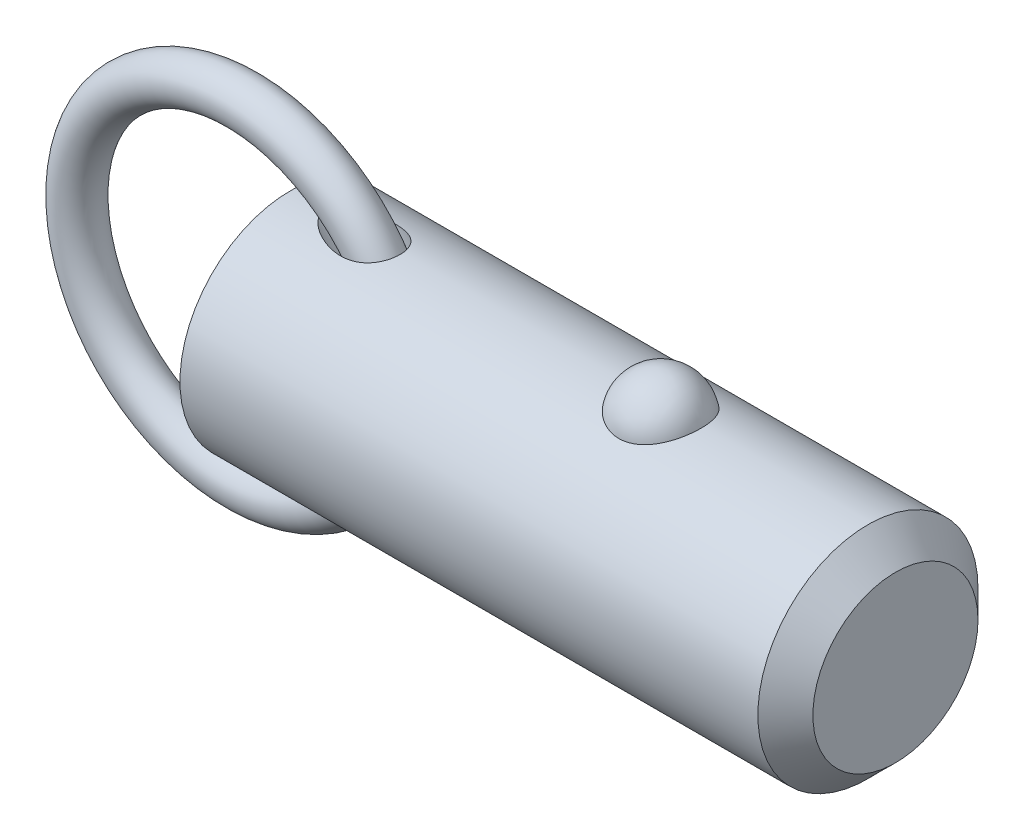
ISO-10303-21;
HEADER;
FILE_DESCRIPTION(('STEP AP214'),'2;1');
FILE_NAME('part.step','',(''),(''),'','','');
FILE_SCHEMA(('AUTOMOTIVE_DESIGN { 1 0 10303 214 1 1 1 1 }'));
ENDSEC;
DATA;
#1=APPLICATION_CONTEXT('core data for automotive mechanical design processes');
#2=APPLICATION_PROTOCOL_DEFINITION('international standard','automotive_design',2000,#1);
#3=PRODUCT_CONTEXT('',#1,'mechanical');
#4=PRODUCT('Part','Part','',(#3));
#5=PRODUCT_RELATED_PRODUCT_CATEGORY('part','',(#4));
#6=PRODUCT_DEFINITION_FORMATION('','',#4);
#7=PRODUCT_DEFINITION_CONTEXT('part definition',#1,'design');
#8=PRODUCT_DEFINITION('design','',#6,#7);
#9=PRODUCT_DEFINITION_SHAPE('','',#8);
#10=(LENGTH_UNIT() NAMED_UNIT(*) SI_UNIT(.MILLI.,.METRE.));
#11=(NAMED_UNIT(*) PLANE_ANGLE_UNIT() SI_UNIT($,.RADIAN.));
#12=(NAMED_UNIT(*) SI_UNIT($,.STERADIAN.) SOLID_ANGLE_UNIT());
#13=UNCERTAINTY_MEASURE_WITH_UNIT(LENGTH_MEASURE(1.E-05),#10,'distance_accuracy_value','');
#14=(GEOMETRIC_REPRESENTATION_CONTEXT(3) GLOBAL_UNCERTAINTY_ASSIGNED_CONTEXT((#13)) GLOBAL_UNIT_ASSIGNED_CONTEXT((#10,
#11,#12)) REPRESENTATION_CONTEXT('',''));
#15=CARTESIAN_POINT('',(0.,0.,0.));
#16=DIRECTION('',(0.,0.,1.));
#17=DIRECTION('',(1.,0.,0.));
#18=AXIS2_PLACEMENT_3D('',#15,#16,#17);
#19=CARTESIAN_POINT('',(-5.53898640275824,0.,0.));
#20=DIRECTION('',(0.,0.,1.));
#21=DIRECTION('',(1.,0.,0.));
#22=AXIS2_PLACEMENT_3D('',#19,#20,#21);
#23=TOROIDAL_SURFACE('',#22,19.05,2.54);
#24=CARTESIAN_POINT('',(16.0510135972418,0.,0.));
#25=VERTEX_POINT('',#24);
#26=VERTEX_LOOP('',#25);
#27=FACE_BOUND('',#26,.T.);
#28=ADVANCED_FACE('P0_F12',(#27),#23,.T.);
#29=CLOSED_SHELL('',(#28));
#30=MANIFOLD_SOLID_BREP('P0_B1',#29);
#31=CARTESIAN_POINT('',(0.,0.,0.));
#32=DIRECTION('',(1.,0.,0.));
#33=DIRECTION('',(0.,0.,-1.));
#34=AXIS2_PLACEMENT_3D('',#31,#32,#33);
#35=CYLINDRICAL_SURFACE('',#34,12.7);
#36=CARTESIAN_POINT('',(66.675,0.,0.));
#37=DIRECTION('',(1.,0.,0.));
#38=DIRECTION('',(0.,0.,-1.));
#39=AXIS2_PLACEMENT_3D('',#36,#37,#38);
#40=CIRCLE('',#39,12.7);
#41=CARTESIAN_POINT('',(66.675,0.,-12.7));
#42=VERTEX_POINT('',#41);
#43=EDGE_CURVE('P1_E89',#42,#42,#40,.T.);
#44=ORIENTED_EDGE('',*,*,#43,.F.);
#45=EDGE_LOOP('',(#44));
#46=FACE_BOUND('',#45,.T.);
#47=CARTESIAN_POINT('',(0.,0.,0.));
#48=DIRECTION('',(1.,0.,0.));
#49=DIRECTION('',(0.,0.,-1.));
#50=AXIS2_PLACEMENT_3D('',#47,#48,#49);
#51=CIRCLE('',#50,12.7);
#52=CARTESIAN_POINT('',(0.,0.,-12.7));
#53=VERTEX_POINT('',#52);
#54=EDGE_CURVE('P1_E52',#53,#53,#51,.T.);
#55=ORIENTED_EDGE('',*,*,#54,.T.);
#56=EDGE_LOOP('',(#55));
#57=FACE_BOUND('',#56,.T.);
#58=CARTESIAN_POINT('',(42.7600429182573,11.7500437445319,4.81938502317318));
#59=CARTESIAN_POINT('',(42.6350881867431,11.7500430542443,4.81938571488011));
#60=CARTESIAN_POINT('',(42.510144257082,11.7520975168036,4.81438658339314));
#61=CARTESIAN_POINT('',(42.2611425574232,11.760253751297,4.79442904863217));
#62=CARTESIAN_POINT('',(42.1370850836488,11.7663568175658,4.77946746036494));
#63=CARTESIAN_POINT('',(41.8909016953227,11.7824262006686,4.73971414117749));
#64=CARTESIAN_POINT('',(41.7687744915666,11.7923898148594,4.71492928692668));
#65=CARTESIAN_POINT('',(41.5271874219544,11.8158938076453,4.65571340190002));
#66=CARTESIAN_POINT('',(41.4077285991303,11.8294355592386,4.6212786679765));
#67=CARTESIAN_POINT('',(41.1725578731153,11.8596812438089,4.54309502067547));
#68=CARTESIAN_POINT('',(41.0568393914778,11.8763792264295,4.49936361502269));
#69=CARTESIAN_POINT('',(40.8296530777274,11.9124878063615,4.40287235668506));
#70=CARTESIAN_POINT('',(40.7181868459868,11.9318994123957,4.35010914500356));
#71=CARTESIAN_POINT('',(40.3912782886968,11.9934256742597,4.17881316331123));
#72=CARTESIAN_POINT('',(40.1831270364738,12.038858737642,4.04720756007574));
#73=CARTESIAN_POINT('',(39.7858509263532,12.1352173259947,3.748564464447));
#74=CARTESIAN_POINT('',(39.5974438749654,12.1862630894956,3.58061821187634));
#75=CARTESIAN_POINT('',(39.2505213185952,12.2875163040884,3.21600758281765));
#76=CARTESIAN_POINT('',(39.0920113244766,12.3377235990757,3.0193379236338));
#77=CARTESIAN_POINT('',(38.8016887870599,12.434492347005,2.592916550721));
#78=CARTESIAN_POINT('',(38.6713762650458,12.4807925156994,2.36208286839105));
#79=CARTESIAN_POINT('',(38.4494079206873,12.5623454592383,1.8807039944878));
#80=CARTESIAN_POINT('',(38.3577554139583,12.5975972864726,1.63015711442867));
#81=CARTESIAN_POINT('',(38.2140466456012,12.6538414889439,1.11298869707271));
#82=CARTESIAN_POINT('',(38.1624990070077,12.6746503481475,0.84620552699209));
#83=CARTESIAN_POINT('',(38.1019771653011,12.699153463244,0.307085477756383));
#84=CARTESIAN_POINT('',(38.0930018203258,12.7028481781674,0.0347487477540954));
#85=CARTESIAN_POINT('',(38.1177310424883,12.6927785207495,-0.506073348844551));
#86=CARTESIAN_POINT('',(38.1511899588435,12.6791146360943,-0.774571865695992));
#87=CARTESIAN_POINT('',(38.2596877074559,12.635882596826,-1.30170246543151));
#88=CARTESIAN_POINT('',(38.3347272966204,12.6063141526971,-1.5603343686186));
#89=CARTESIAN_POINT('',(38.5250000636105,12.5342328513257,-2.06083899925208));
#90=CARTESIAN_POINT('',(38.6402872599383,12.4917026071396,-2.3026886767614));
#91=CARTESIAN_POINT('',(38.9087044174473,12.3981123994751,-2.76259600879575));
#92=CARTESIAN_POINT('',(39.0618374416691,12.3470517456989,-2.98065173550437));
#93=CARTESIAN_POINT('',(39.4035077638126,12.2416045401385,-3.38786328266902));
#94=CARTESIAN_POINT('',(39.5922017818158,12.1872040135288,-3.57688418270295));
#95=CARTESIAN_POINT('',(40.0002392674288,12.0814086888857,-3.91941073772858));
#96=CARTESIAN_POINT('',(40.2195800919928,12.0300136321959,-4.07291945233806));
#97=CARTESIAN_POINT('',(40.6783753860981,11.9373542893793,-4.33691289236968));
#98=CARTESIAN_POINT('',(40.9173044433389,11.8958982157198,-4.44824125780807));
#99=CARTESIAN_POINT('',(41.4124376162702,11.8268116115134,-4.62881985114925));
#100=CARTESIAN_POINT('',(41.6686351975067,11.7991758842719,-4.69808589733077));
#101=CARTESIAN_POINT('',(42.1771640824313,11.7622209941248,-4.78983181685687));
#102=CARTESIAN_POINT('',(42.4290414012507,11.7520502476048,-4.81449025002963));
#103=CARTESIAN_POINT('',(42.9335734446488,11.7485796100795,-4.82295735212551));
#104=CARTESIAN_POINT('',(43.1862280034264,11.7552763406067,-4.80677420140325));
#105=CARTESIAN_POINT('',(43.6768341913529,11.7842584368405,-4.73525430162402));
#106=CARTESIAN_POINT('',(43.9149984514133,11.8060486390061,-4.68116061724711));
#107=CARTESIAN_POINT('',(44.3784894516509,11.8622750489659,-4.53678133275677));
#108=CARTESIAN_POINT('',(44.6038151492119,11.8967122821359,-4.44649279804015));
#109=CARTESIAN_POINT('',(45.0408018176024,11.9754603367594,-4.2298761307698));
#110=CARTESIAN_POINT('',(45.2520579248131,12.0199699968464,-4.10280539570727));
#111=CARTESIAN_POINT('',(45.6506012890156,12.1138028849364,-3.81685409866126));
#112=CARTESIAN_POINT('',(45.8378830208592,12.163127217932,-3.65796622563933));
#113=CARTESIAN_POINT('',(46.1933509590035,12.2642343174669,-3.30364864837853));
#114=CARTESIAN_POINT('',(46.3601119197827,12.3160165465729,-3.10678783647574));
#115=CARTESIAN_POINT('',(46.6595799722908,12.4142566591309,-2.68748409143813));
#116=CARTESIAN_POINT('',(46.7922809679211,12.4607135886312,-2.46503658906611));
#117=CARTESIAN_POINT('',(47.0246912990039,12.5450236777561,-1.9928951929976));
#118=CARTESIAN_POINT('',(47.123215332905,12.5825557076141,-1.7425591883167));
#119=CARTESIAN_POINT('',(47.2792277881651,12.6431720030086,-1.22773734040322));
#120=CARTESIAN_POINT('',(47.3367157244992,12.6662560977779,-0.963251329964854));
#121=CARTESIAN_POINT('',(47.4095441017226,12.6956486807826,-0.427355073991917));
#122=CARTESIAN_POINT('',(47.4248378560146,12.7019385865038,-0.1559374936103));
#123=CARTESIAN_POINT('',(47.4127794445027,12.6970201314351,0.385928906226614));
#124=CARTESIAN_POINT('',(47.3854280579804,12.6858120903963,0.656377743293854));
#125=CARTESIAN_POINT('',(47.3130609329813,12.6568455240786,1.05454017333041));
#126=CARTESIAN_POINT('',(47.2837963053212,12.6451962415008,1.18577850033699));
#127=CARTESIAN_POINT('',(47.2150228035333,12.6181819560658,1.44513808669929));
#128=CARTESIAN_POINT('',(47.1755176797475,12.6028183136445,1.57326046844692));
#129=CARTESIAN_POINT('',(47.0864397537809,12.5687547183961,1.82554978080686));
#130=CARTESIAN_POINT('',(47.0368627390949,12.5500533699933,1.9497150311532));
#131=CARTESIAN_POINT('',(46.9279211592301,12.5098093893,2.1931437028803));
#132=CARTESIAN_POINT('',(46.8685601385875,12.4882677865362,2.31240887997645));
#133=CARTESIAN_POINT('',(46.7399712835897,12.4427679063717,2.54593031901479));
#134=CARTESIAN_POINT('',(46.6706888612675,12.4187964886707,2.66015396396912));
#135=CARTESIAN_POINT('',(46.522903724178,12.3691892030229,2.88202659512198));
#136=CARTESIAN_POINT('',(46.4444044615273,12.3435539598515,2.98967802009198));
#137=CARTESIAN_POINT('',(46.2785502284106,12.2912955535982,3.19774385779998));
#138=CARTESIAN_POINT('',(46.1911918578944,12.2646720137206,3.29815546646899));
#139=CARTESIAN_POINT('',(46.0081617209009,12.2111945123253,3.49095035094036));
#140=CARTESIAN_POINT('',(45.9124932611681,12.1843406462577,3.58333679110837));
#141=CARTESIAN_POINT('',(45.7136272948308,12.1312249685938,3.75922876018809));
#142=CARTESIAN_POINT('',(45.6104503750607,12.104961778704,3.84275713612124));
#143=CARTESIAN_POINT('',(45.3970133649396,12.0537284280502,4.00056406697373));
#144=CARTESIAN_POINT('',(45.2867562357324,12.028757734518,4.07484645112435));
#145=CARTESIAN_POINT('',(45.0597550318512,11.9808306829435,4.21367959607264));
#146=CARTESIAN_POINT('',(44.9430068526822,11.9578756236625,4.27822410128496));
#147=CARTESIAN_POINT('',(44.7039425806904,11.9147184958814,4.39698483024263));
#148=CARTESIAN_POINT('',(44.5816287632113,11.894515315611,4.45120522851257));
#149=CARTESIAN_POINT('',(44.322952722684,11.8561129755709,4.55255353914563));
#150=CARTESIAN_POINT('',(44.1862237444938,11.8381764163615,4.59884858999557));
#151=CARTESIAN_POINT('',(43.9086087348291,11.8069093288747,4.67853897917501));
#152=CARTESIAN_POINT('',(43.7677245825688,11.7935767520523,4.71194005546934));
#153=CARTESIAN_POINT('',(43.4830944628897,11.7720277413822,4.76552188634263));
#154=CARTESIAN_POINT('',(43.3393488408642,11.7638106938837,4.78570422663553));
#155=CARTESIAN_POINT('',(43.0504114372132,11.7528195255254,4.81263433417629));
#156=CARTESIAN_POINT('',(42.9052198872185,11.7500445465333,4.81938421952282));
#157=CARTESIAN_POINT('',(42.7600429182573,11.7500437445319,4.81938502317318));
#158=B_SPLINE_CURVE_WITH_KNOTS('',3,(#58,#59,#60,#61,#62,#63,#64,#65,#66,#67,#68,#69,#70,#71,
#72,#73,#74,#75,#76,#77,#78,#79,#80,#81,#82,#83,#84,#85,#86,#87,#88,#89,#90,#91,#92,#93,#94,#95,
#96,#97,#98,#99,#100,#101,#102,#103,#104,#105,#106,#107,#108,#109,#110,#111,#112,#113,#114,#115,
#116,#117,#118,#119,#120,#121,#122,#123,#124,#125,#126,#127,#128,#129,#130,#131,#132,#133,#134,
#135,#136,#137,#138,#139,#140,#141,#142,#143,#144,#145,#146,#147,#148,#149,#150,#151,#152,#153,
#154,#155,#156,#157),.UNSPECIFIED.,.T.,.F.,(4,2,2,2,2,2,2,2,2,2,2,2,2,2,2,2,2,2,2,2,2,2,2,2,2,2,
2,2,2,2,2,2,2,2,2,2,2,2,2,2,2,2,2,2,2,2,2,2,2,4),(0.,0.374729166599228,0.749578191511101,
1.12416526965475,1.49889629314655,1.87292776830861,2.24709865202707,2.99481328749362,
3.76399449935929,4.53331735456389,5.3368391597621,6.14042986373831,6.95405296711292,
7.76765424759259,8.57656703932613,9.38549455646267,10.1955119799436,11.0055949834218,
11.8193353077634,12.6330054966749,13.4294141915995,14.2255231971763,14.9815786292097,
15.7374826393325,16.4696948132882,17.2019663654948,17.9501979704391,18.6986017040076,
19.4844704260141,20.2704797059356,21.0815215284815,21.8925729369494,22.7045213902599,
23.5164550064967,23.9209608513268,24.3253187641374,24.7298461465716,25.1342272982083,
25.54092555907,25.9474719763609,26.3541750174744,26.7607169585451,27.1661834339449,
27.5714814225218,27.9770386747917,28.3824315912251,28.8181206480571,29.2536155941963,
29.6890582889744,30.1244323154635),.UNSPECIFIED.);
#159=CARTESIAN_POINT('',(42.7600429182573,11.7500437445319,4.81938502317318));
#160=VERTEX_POINT('',#159);
#161=EDGE_CURVE('P1_E80',#160,#160,#158,.T.);
#162=ORIENTED_EDGE('',*,*,#161,.T.);
#163=EDGE_LOOP('',(#162));
#164=FACE_BOUND('',#163,.T.);
#165=CARTESIAN_POINT('',(-5.53898640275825,0.,0.));
#166=DIRECTION('',(0.796400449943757,-0.604769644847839,0.));
#167=DIRECTION('',(0.604769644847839,0.796400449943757,0.));
#168=AXIS2_PLACEMENT_3D('',#165,#166,#167);
#169=ELLIPSE('',#168,15.9467514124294,12.7);
#170=CARTESIAN_POINT('',(4.0948214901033,12.6864319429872,0.586893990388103));
#171=VERTEX_POINT('',#170);
#172=CARTESIAN_POINT('',(4.0948214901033,12.6864319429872,-0.586893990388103));
#173=VERTEX_POINT('',#172);
#174=EDGE_CURVE('P1_E47',#171,#173,#169,.F.);
#175=ORIENTED_EDGE('',*,*,#174,.T.);
#176=CARTESIAN_POINT('',(4.06153170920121,12.6905758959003,-0.48916605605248));
#177=CARTESIAN_POINT('',(4.08111374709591,12.6881366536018,-0.552489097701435));
#178=CARTESIAN_POINT('',(4.10417851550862,12.6852663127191,-0.614604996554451));
#179=CARTESIAN_POINT('',(4.15628434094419,12.6787965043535,-0.736067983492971));
#180=CARTESIAN_POINT('',(4.18531032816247,12.6751988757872,-0.795421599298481));
#181=CARTESIAN_POINT('',(4.27911159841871,12.6636052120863,-0.967590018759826));
#182=CARTESIAN_POINT('',(4.35123408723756,12.654730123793,-1.07635920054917));
#183=CARTESIAN_POINT('',(4.49106800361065,12.6376715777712,-1.25922957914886));
#184=CARTESIAN_POINT('',(4.55601066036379,12.6297947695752,-1.33556751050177));
#185=CARTESIAN_POINT('',(4.69223626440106,12.6134116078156,-1.48232741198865));
#186=CARTESIAN_POINT('',(4.76352147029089,12.6049050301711,-1.55274725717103));
#187=CARTESIAN_POINT('',(4.91163946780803,12.587417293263,-1.68868704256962));
#188=CARTESIAN_POINT('',(4.98851399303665,12.5784327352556,-1.75416062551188));
#189=CARTESIAN_POINT('',(5.14630057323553,12.560235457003,-1.88003275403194));
#190=CARTESIAN_POINT('',(5.22721398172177,12.5510226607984,-1.94042957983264));
#191=CARTESIAN_POINT('',(5.45368877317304,12.5256514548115,-2.09966332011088));
#192=CARTESIAN_POINT('',(5.60261616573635,12.5094182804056,-2.19371988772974));
#193=CARTESIAN_POINT('',(5.90795545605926,12.4774211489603,-2.36893890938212));
#194=CARTESIAN_POINT('',(6.06437232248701,12.4616575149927,-2.45009264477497));
#195=CARTESIAN_POINT('',(6.38306132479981,12.431227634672,-2.60008249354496));
#196=CARTESIAN_POINT('',(6.54533237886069,12.4165611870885,-2.66892086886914));
#197=CARTESIAN_POINT('',(6.87462618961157,12.3889351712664,-2.79435199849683));
#198=CARTESIAN_POINT('',(7.0416477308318,12.3759751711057,-2.85094785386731));
#199=CARTESIAN_POINT('',(7.38726647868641,12.3518460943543,-2.95377962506));
#200=CARTESIAN_POINT('',(7.56604577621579,12.3407843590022,-2.9994320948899));
#201=CARTESIAN_POINT('',(7.92698692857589,12.3219309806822,-3.07596683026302));
#202=CARTESIAN_POINT('',(8.10914972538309,12.314140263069,-3.1068449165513));
#203=CARTESIAN_POINT('',(8.47511457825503,12.3025918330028,-3.15226850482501));
#204=CARTESIAN_POINT('',(8.6589097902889,12.2988216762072,-3.16686440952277));
#205=CARTESIAN_POINT('',(9.02696087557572,12.2959421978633,-3.17802250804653));
#206=CARTESIAN_POINT('',(9.21121628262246,12.2968292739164,-3.17459864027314));
#207=CARTESIAN_POINT('',(9.61636263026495,12.3045198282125,-3.14471110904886));
#208=CARTESIAN_POINT('',(9.83695552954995,12.3125080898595,-3.1136323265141));
#209=CARTESIAN_POINT('',(10.1619126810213,12.3303028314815,-3.04206574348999));
#210=CARTESIAN_POINT('',(10.2692747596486,12.3372061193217,-3.01403983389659));
#211=CARTESIAN_POINT('',(10.4811758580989,12.3528538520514,-2.94925947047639));
#212=CARTESIAN_POINT('',(10.5857162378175,12.361597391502,-2.91250930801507));
#213=CARTESIAN_POINT('',(10.7921321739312,12.3808585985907,-2.82951748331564));
#214=CARTESIAN_POINT('',(10.8939665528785,12.3913944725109,-2.78317723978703));
#215=CARTESIAN_POINT('',(11.0926118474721,12.4138762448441,-2.68112002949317));
#216=CARTESIAN_POINT('',(11.1894254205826,12.4258213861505,-2.62540809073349));
#217=CARTESIAN_POINT('',(11.3768740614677,12.4507225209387,-2.5046565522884));
#218=CARTESIAN_POINT('',(11.46751150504,12.4636781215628,-2.43962056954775));
#219=CARTESIAN_POINT('',(11.6414572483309,12.4901070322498,-2.30048560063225));
#220=CARTESIAN_POINT('',(11.7247669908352,12.5035802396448,-2.2263884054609));
#221=CARTESIAN_POINT('',(11.8713131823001,12.5285000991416,-2.08117367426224));
#222=CARTESIAN_POINT('',(11.9357009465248,12.5399538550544,-2.0112159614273));
#223=CARTESIAN_POINT('',(12.0576805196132,12.5624496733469,-1.86555293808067));
#224=CARTESIAN_POINT('',(12.1152732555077,12.5734917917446,-1.78984841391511));
#225=CARTESIAN_POINT('',(12.2230738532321,12.5947858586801,-1.63327883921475));
#226=CARTESIAN_POINT('',(12.2732844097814,12.6050380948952,-1.55241568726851));
#227=CARTESIAN_POINT('',(12.3658430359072,12.6243983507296,-1.38621267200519));
#228=CARTESIAN_POINT('',(12.4081916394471,12.6335064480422,-1.30087311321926));
#229=CARTESIAN_POINT('',(12.5150098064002,12.6569076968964,-1.05702619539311));
#230=CARTESIAN_POINT('',(12.5703399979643,12.6695746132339,-0.894232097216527));
#231=CARTESIAN_POINT('',(12.6526225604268,12.6886816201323,-0.561391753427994));
#232=CARTESIAN_POINT('',(12.6795825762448,12.6951233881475,-0.391347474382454));
#233=CARTESIAN_POINT('',(12.7041016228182,12.7009766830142,-0.0537636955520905));
#234=CARTESIAN_POINT('',(12.7024538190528,12.7005778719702,0.113714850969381));
#235=CARTESIAN_POINT('',(12.6717240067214,12.6932548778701,0.445979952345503));
#236=CARTESIAN_POINT('',(12.6426435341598,12.6863310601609,0.610766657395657));
#237=CARTESIAN_POINT('',(12.5579769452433,12.6667465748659,0.932429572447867));
#238=CARTESIAN_POINT('',(12.5024793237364,12.6541050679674,1.08933027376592));
#239=CARTESIAN_POINT('',(12.3665691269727,12.6244558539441,1.39146752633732));
#240=CARTESIAN_POINT('',(12.2861577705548,12.6074483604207,1.53670464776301));
#241=CARTESIAN_POINT('',(12.1018203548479,12.5706804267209,1.81319588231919));
#242=CARTESIAN_POINT('',(11.9976588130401,12.5508932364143,1.94428915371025));
#243=CARTESIAN_POINT('',(11.7695265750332,12.5107540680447,2.18776051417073));
#244=CARTESIAN_POINT('',(11.6455540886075,12.4904020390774,2.30013691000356));
#245=CARTESIAN_POINT('',(11.3759347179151,12.4502278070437,2.50870972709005));
#246=CARTESIAN_POINT('',(11.2295880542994,12.4304654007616,2.60400962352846));
#247=CARTESIAN_POINT('',(10.9239803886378,12.3941696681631,2.7716292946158));
#248=CARTESIAN_POINT('',(10.7647152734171,12.3776373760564,2.84394171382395));
#249=CARTESIAN_POINT('',(10.4192039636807,12.3473062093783,2.9730352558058));
#250=CARTESIAN_POINT('',(10.231933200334,12.3340204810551,3.02717164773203));
#251=CARTESIAN_POINT('',(9.85152982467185,12.3134301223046,3.10986173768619));
#252=CARTESIAN_POINT('',(9.65839336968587,12.3061295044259,3.13839827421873));
#253=CARTESIAN_POINT('',(9.31022514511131,12.2982822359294,3.16897517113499));
#254=CARTESIAN_POINT('',(9.15555718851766,12.2966525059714,3.1752689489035));
#255=CARTESIAN_POINT('',(8.84618945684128,12.2967963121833,3.17471335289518));
#256=CARTESIAN_POINT('',(8.69148970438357,12.2985715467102,3.16785742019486));
#257=CARTESIAN_POINT('',(8.3828047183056,12.3051648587,3.14214692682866));
#258=CARTESIAN_POINT('',(8.22882218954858,12.3099904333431,3.12326280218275));
#259=CARTESIAN_POINT('',(7.92276070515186,12.3222644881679,3.07448013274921));
#260=CARTESIAN_POINT('',(7.77068148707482,12.3297126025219,3.04458312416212));
#261=CARTESIAN_POINT('',(7.46452663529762,12.3470493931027,2.97350781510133));
#262=CARTESIAN_POINT('',(7.31052714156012,12.3570043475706,2.93201910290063));
#263=CARTESIAN_POINT('',(7.00579083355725,12.3787609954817,2.83876185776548));
#264=CARTESIAN_POINT('',(6.85505451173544,12.3905629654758,2.78699178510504));
#265=CARTESIAN_POINT('',(6.55781208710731,12.415528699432,2.67357744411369));
#266=CARTESIAN_POINT('',(6.41129783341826,12.4286895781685,2.61195394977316));
#267=CARTESIAN_POINT('',(6.12302950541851,12.4559398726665,2.47874512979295));
#268=CARTESIAN_POINT('',(5.98127390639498,12.4700289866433,2.40716303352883));
#269=CARTESIAN_POINT('',(5.67073126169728,12.5020754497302,2.23550426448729));
#270=CARTESIAN_POINT('',(5.50343839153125,12.5201625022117,2.13268685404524));
#271=CARTESIAN_POINT('',(5.26147616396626,12.5471537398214,1.96522579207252));
#272=CARTESIAN_POINT('',(5.18224299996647,12.5561365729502,1.90713440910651));
#273=CARTESIAN_POINT('',(5.02746475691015,12.573912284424,1.78618989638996));
#274=CARTESIAN_POINT('',(4.95191912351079,12.5827051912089,1.72333748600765));
#275=CARTESIAN_POINT('',(4.8178716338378,12.598469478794,1.60360864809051));
#276=CARTESIAN_POINT('',(4.75865966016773,12.6054958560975,1.54753994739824));
#277=CARTESIAN_POINT('',(4.64406285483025,12.6191906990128,1.43158546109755));
#278=CARTESIAN_POINT('',(4.5886792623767,12.6258590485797,1.37169845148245));
#279=CARTESIAN_POINT('',(4.43014912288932,12.6450546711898,1.18656670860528));
#280=CARTESIAN_POINT('',(4.3337272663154,12.6568788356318,1.05507993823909));
#281=CARTESIAN_POINT('',(4.21252055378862,12.6718304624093,0.84805289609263));
#282=CARTESIAN_POINT('',(4.17660155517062,12.6762773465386,0.779100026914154));
#283=CARTESIAN_POINT('',(4.11264979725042,12.6842122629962,0.637080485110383));
#284=CARTESIAN_POINT('',(4.08466792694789,12.6876941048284,0.563990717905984));
#285=CARTESIAN_POINT('',(4.06153170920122,12.6905758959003,0.489166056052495));
#286=B_SPLINE_CURVE_WITH_KNOTS('',3,(#176,#177,#178,#179,#180,#181,#182,#183,#184,#185,#186,
#187,#188,#189,#190,#191,#192,#193,#194,#195,#196,#197,#198,#199,#200,#201,#202,#203,#204,#205,
#206,#207,#208,#209,#210,#211,#212,#213,#214,#215,#216,#217,#218,#219,#220,#221,#222,#223,#224,
#225,#226,#227,#228,#229,#230,#231,#232,#233,#234,#235,#236,#237,#238,#239,#240,#241,#242,#243,
#244,#245,#246,#247,#248,#249,#250,#251,#252,#253,#254,#255,#256,#257,#258,#259,#260,#261,#262,
#263,#264,#265,#266,#267,#268,#269,#270,#271,#272,#273,#274,#275,#276,#277,#278,#279,#280,#281,
#282,#283,#284,#285),.UNSPECIFIED.,.F.,.F.,(4,2,2,2,2,2,2,2,2,2,2,2,2,2,2,2,2,2,2,2,2,2,2,2,2,2,
2,2,2,2,2,2,2,2,2,2,2,2,2,2,2,2,2,2,2,2,2,2,2,2,2,2,2,2,4),(0.,0.198708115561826,
0.39691995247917,0.787580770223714,1.08882492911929,1.39017679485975,1.69407136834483,
1.99806847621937,2.52793143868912,3.05815092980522,3.58827293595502,4.11826050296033,
4.67218806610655,5.22627222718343,5.77863637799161,6.3305733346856,6.99657211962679,
7.32977411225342,7.66281254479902,7.99946156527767,8.33593054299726,8.67226935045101,
9.00854178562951,9.29544181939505,9.58230266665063,9.86905853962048,10.1557949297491,
10.6702338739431,11.1845341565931,11.6845985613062,12.1846349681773,12.6830079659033,
13.1813565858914,13.68487951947,14.1884479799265,14.713533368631,15.2387866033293,
15.8228373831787,16.407279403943,16.8710810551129,17.3351141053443,17.8002921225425,
18.2654052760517,18.7444169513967,19.2235004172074,19.701586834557,20.1795185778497,
20.7699825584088,21.0658110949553,21.3615950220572,21.606957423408,21.8523988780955,
22.3397467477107,22.5729183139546,22.8075527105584),.UNSPECIFIED.);
#287=EDGE_CURVE('P1_E51',#173,#171,#286,.T.);
#288=ORIENTED_EDGE('',*,*,#287,.T.);
#289=EDGE_LOOP('',(#175,#288));
#290=FACE_BOUND('',#289,.T.);
#291=CARTESIAN_POINT('',(-5.53898640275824,0.,0.));
#292=DIRECTION('',(-0.796400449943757,-0.604769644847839,0.));
#293=DIRECTION('',(0.604769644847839,-0.796400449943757,0.));
#294=AXIS2_PLACEMENT_3D('',#291,#292,#293);
#295=ELLIPSE('',#294,15.9467514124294,12.7);
#296=CARTESIAN_POINT('',(4.09482149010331,-12.6864319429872,0.586893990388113));
#297=VERTEX_POINT('',#296);
#298=CARTESIAN_POINT('',(4.09482149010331,-12.6864319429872,-0.586893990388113));
#299=VERTEX_POINT('',#298);
#300=EDGE_CURVE('P1_E28',#297,#299,#295,.F.);
#301=ORIENTED_EDGE('',*,*,#300,.F.);
#302=CARTESIAN_POINT('',(4.06153170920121,-12.6905758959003,0.489166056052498));
#303=CARTESIAN_POINT('',(4.08111374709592,-12.6881366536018,0.552489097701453));
#304=CARTESIAN_POINT('',(4.10417851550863,-12.6852663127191,0.614604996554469));
#305=CARTESIAN_POINT('',(4.1562843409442,-12.6787965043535,0.736067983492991));
#306=CARTESIAN_POINT('',(4.18531032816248,-12.6751988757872,0.795421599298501));
#307=CARTESIAN_POINT('',(4.27911159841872,-12.6636052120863,0.96759001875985));
#308=CARTESIAN_POINT('',(4.35123408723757,-12.654730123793,1.07635920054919));
#309=CARTESIAN_POINT('',(4.49106800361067,-12.6376715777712,1.25922957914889));
#310=CARTESIAN_POINT('',(4.55601066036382,-12.6297947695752,1.33556751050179));
#311=CARTESIAN_POINT('',(4.69223626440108,-12.6134116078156,1.48232741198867));
#312=CARTESIAN_POINT('',(4.76352147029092,-12.6049050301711,1.55274725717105));
#313=CARTESIAN_POINT('',(4.91163946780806,-12.587417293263,1.68868704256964));
#314=CARTESIAN_POINT('',(4.98851399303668,-12.5784327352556,1.7541606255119));
#315=CARTESIAN_POINT('',(5.14630057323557,-12.560235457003,1.88003275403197));
#316=CARTESIAN_POINT('',(5.2272139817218,-12.5510226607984,1.94042957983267));
#317=CARTESIAN_POINT('',(5.45368877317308,-12.5256514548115,2.09966332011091));
#318=CARTESIAN_POINT('',(5.6026161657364,-12.5094182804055,2.19371988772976));
#319=CARTESIAN_POINT('',(5.90795545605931,-12.4774211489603,2.36893890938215));
#320=CARTESIAN_POINT('',(6.06437232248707,-12.4616575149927,2.450092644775));
#321=CARTESIAN_POINT('',(6.38306132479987,-12.431227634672,2.60008249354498));
#322=CARTESIAN_POINT('',(6.54533237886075,-12.4165611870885,2.66892086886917));
#323=CARTESIAN_POINT('',(6.87462618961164,-12.3889351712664,2.79435199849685));
#324=CARTESIAN_POINT('',(7.04164773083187,-12.3759751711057,2.85094785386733));
#325=CARTESIAN_POINT('',(7.38726647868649,-12.3518460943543,2.95377962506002));
#326=CARTESIAN_POINT('',(7.56604577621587,-12.3407843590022,2.99943209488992));
#327=CARTESIAN_POINT('',(7.92698692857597,-12.3219309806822,3.07596683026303));
#328=CARTESIAN_POINT('',(8.10914972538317,-12.314140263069,3.10684491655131));
#329=CARTESIAN_POINT('',(8.47511457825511,-12.3025918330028,3.15226850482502));
#330=CARTESIAN_POINT('',(8.65890979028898,-12.2988216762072,3.16686440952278));
#331=CARTESIAN_POINT('',(9.02696087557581,-12.2959421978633,3.17802250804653));
#332=CARTESIAN_POINT('',(9.21121628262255,-12.2968292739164,3.17459864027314));
#333=CARTESIAN_POINT('',(9.61636263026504,-12.3045198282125,3.14471110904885));
#334=CARTESIAN_POINT('',(9.83695552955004,-12.3125080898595,3.11363232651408));
#335=CARTESIAN_POINT('',(10.1619126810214,-12.3303028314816,3.04206574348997));
#336=CARTESIAN_POINT('',(10.2692747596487,-12.3372061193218,3.01403983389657));
#337=CARTESIAN_POINT('',(10.481175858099,-12.3528538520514,2.94925947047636));
#338=CARTESIAN_POINT('',(10.5857162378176,-12.361597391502,2.91250930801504));
#339=CARTESIAN_POINT('',(10.7921321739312,-12.3808585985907,2.82951748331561));
#340=CARTESIAN_POINT('',(10.8939665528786,-12.3913944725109,2.783177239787));
#341=CARTESIAN_POINT('',(11.0926118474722,-12.4138762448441,2.68112002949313));
#342=CARTESIAN_POINT('',(11.1894254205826,-12.4258213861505,2.62540809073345));
#343=CARTESIAN_POINT('',(11.3768740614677,-12.4507225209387,2.50465655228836));
#344=CARTESIAN_POINT('',(11.4675115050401,-12.4636781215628,2.43962056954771));
#345=CARTESIAN_POINT('',(11.641457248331,-12.4901070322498,2.30048560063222));
#346=CARTESIAN_POINT('',(11.7247669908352,-12.5035802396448,2.22638840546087));
#347=CARTESIAN_POINT('',(11.8713131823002,-12.5285000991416,2.0811736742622));
#348=CARTESIAN_POINT('',(11.9357009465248,-12.5399538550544,2.01121596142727));
#349=CARTESIAN_POINT('',(12.0576805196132,-12.5624496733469,1.86555293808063));
#350=CARTESIAN_POINT('',(12.1152732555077,-12.5734917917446,1.78984841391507));
#351=CARTESIAN_POINT('',(12.2230738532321,-12.5947858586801,1.63327883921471));
#352=CARTESIAN_POINT('',(12.2732844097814,-12.6050380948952,1.55241568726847));
#353=CARTESIAN_POINT('',(12.3658430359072,-12.6243983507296,1.38621267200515));
#354=CARTESIAN_POINT('',(12.4081916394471,-12.6335064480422,1.30087311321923));
#355=CARTESIAN_POINT('',(12.5150098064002,-12.6569076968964,1.05702619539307));
#356=CARTESIAN_POINT('',(12.5703399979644,-12.6695746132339,0.894232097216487));
#357=CARTESIAN_POINT('',(12.6526225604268,-12.6886816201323,0.561391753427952));
#358=CARTESIAN_POINT('',(12.6795825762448,-12.6951233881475,0.391347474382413));
#359=CARTESIAN_POINT('',(12.7041016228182,-12.7009766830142,0.0537636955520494));
#360=CARTESIAN_POINT('',(12.7024538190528,-12.7005778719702,-0.113714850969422));
#361=CARTESIAN_POINT('',(12.6717240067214,-12.6932548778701,-0.445979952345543));
#362=CARTESIAN_POINT('',(12.6426435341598,-12.6863310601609,-0.610766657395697));
#363=CARTESIAN_POINT('',(12.5579769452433,-12.6667465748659,-0.932429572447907));
#364=CARTESIAN_POINT('',(12.5024793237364,-12.6541050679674,-1.08933027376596));
#365=CARTESIAN_POINT('',(12.3665691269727,-12.6244558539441,-1.39146752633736));
#366=CARTESIAN_POINT('',(12.2861577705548,-12.6074483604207,-1.53670464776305));
#367=CARTESIAN_POINT('',(12.1018203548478,-12.5706804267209,-1.81319588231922));
#368=CARTESIAN_POINT('',(11.99765881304,-12.5508932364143,-1.94428915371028));
#369=CARTESIAN_POINT('',(11.7695265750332,-12.5107540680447,-2.18776051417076));
#370=CARTESIAN_POINT('',(11.6455540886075,-12.4904020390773,-2.30013691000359));
#371=CARTESIAN_POINT('',(11.375934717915,-12.4502278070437,-2.50870972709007));
#372=CARTESIAN_POINT('',(11.2295880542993,-12.4304654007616,-2.60400962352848));
#373=CARTESIAN_POINT('',(10.9239803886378,-12.3941696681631,-2.77162929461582));
#374=CARTESIAN_POINT('',(10.764715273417,-12.3776373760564,-2.84394171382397));
#375=CARTESIAN_POINT('',(10.4192039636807,-12.3473062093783,-2.97303525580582));
#376=CARTESIAN_POINT('',(10.2319332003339,-12.3340204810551,-3.02717164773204));
#377=CARTESIAN_POINT('',(9.85152982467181,-12.3134301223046,-3.1098617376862));
#378=CARTESIAN_POINT('',(9.65839336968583,-12.3061295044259,-3.13839827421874));
#379=CARTESIAN_POINT('',(9.31022514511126,-12.2982822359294,-3.16897517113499));
#380=CARTESIAN_POINT('',(9.15555718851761,-12.2966525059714,-3.1752689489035));
#381=CARTESIAN_POINT('',(8.84618945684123,-12.2967963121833,-3.17471335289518));
#382=CARTESIAN_POINT('',(8.69148970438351,-12.2985715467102,-3.16785742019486));
#383=CARTESIAN_POINT('',(8.38280471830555,-12.3051648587,-3.14214692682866));
#384=CARTESIAN_POINT('',(8.22882218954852,-12.3099904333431,-3.12326280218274));
#385=CARTESIAN_POINT('',(7.9227607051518,-12.3222644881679,-3.0744801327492));
#386=CARTESIAN_POINT('',(7.77068148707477,-12.329712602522,-3.04458312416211));
#387=CARTESIAN_POINT('',(7.46452663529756,-12.3470493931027,-2.97350781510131));
#388=CARTESIAN_POINT('',(7.31052714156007,-12.3570043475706,-2.93201910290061));
#389=CARTESIAN_POINT('',(7.00579083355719,-12.3787609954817,-2.83876185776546));
#390=CARTESIAN_POINT('',(6.85505451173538,-12.3905629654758,-2.78699178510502));
#391=CARTESIAN_POINT('',(6.55781208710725,-12.415528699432,-2.67357744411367));
#392=CARTESIAN_POINT('',(6.41129783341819,-12.4286895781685,-2.61195394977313));
#393=CARTESIAN_POINT('',(6.12302950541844,-12.4559398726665,-2.47874512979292));
#394=CARTESIAN_POINT('',(5.98127390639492,-12.4700289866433,-2.40716303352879));
#395=CARTESIAN_POINT('',(5.67073126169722,-12.5020754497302,-2.23550426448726));
#396=CARTESIAN_POINT('',(5.50343839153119,-12.5201625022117,-2.13268685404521));
#397=CARTESIAN_POINT('',(5.26147616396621,-12.5471537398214,-1.96522579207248));
#398=CARTESIAN_POINT('',(5.18224299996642,-12.5561365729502,-1.90713440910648));
#399=CARTESIAN_POINT('',(5.02746475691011,-12.573912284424,-1.78618989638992));
#400=CARTESIAN_POINT('',(4.95191912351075,-12.5827051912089,-1.72333748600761));
#401=CARTESIAN_POINT('',(4.81787163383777,-12.598469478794,-1.60360864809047));
#402=CARTESIAN_POINT('',(4.75865966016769,-12.6054958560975,-1.5475399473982));
#403=CARTESIAN_POINT('',(4.64406285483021,-12.6191906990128,-1.43158546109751));
#404=CARTESIAN_POINT('',(4.58867926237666,-12.6258590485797,-1.37169845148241));
#405=CARTESIAN_POINT('',(4.4301491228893,-12.6450546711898,-1.18656670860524));
#406=CARTESIAN_POINT('',(4.33372726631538,-12.6568788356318,-1.05507993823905));
#407=CARTESIAN_POINT('',(4.21252055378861,-12.6718304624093,-0.848052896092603));
#408=CARTESIAN_POINT('',(4.1766015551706,-12.6762773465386,-0.779100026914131));
#409=CARTESIAN_POINT('',(4.1126497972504,-12.6842122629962,-0.637080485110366));
#410=CARTESIAN_POINT('',(4.08466792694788,-12.6876941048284,-0.563990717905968));
#411=CARTESIAN_POINT('',(4.06153170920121,-12.6905758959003,-0.489166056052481));
#412=B_SPLINE_CURVE_WITH_KNOTS('',3,(#302,#303,#304,#305,#306,#307,#308,#309,#310,#311,#312,
#313,#314,#315,#316,#317,#318,#319,#320,#321,#322,#323,#324,#325,#326,#327,#328,#329,#330,#331,
#332,#333,#334,#335,#336,#337,#338,#339,#340,#341,#342,#343,#344,#345,#346,#347,#348,#349,#350,
#351,#352,#353,#354,#355,#356,#357,#358,#359,#360,#361,#362,#363,#364,#365,#366,#367,#368,#369,
#370,#371,#372,#373,#374,#375,#376,#377,#378,#379,#380,#381,#382,#383,#384,#385,#386,#387,#388,
#389,#390,#391,#392,#393,#394,#395,#396,#397,#398,#399,#400,#401,#402,#403,#404,#405,#406,#407,
#408,#409,#410,#411),.UNSPECIFIED.,.F.,.F.,(4,2,2,2,2,2,2,2,2,2,2,2,2,2,2,2,2,2,2,2,2,2,2,2,2,2,
2,2,2,2,2,2,2,2,2,2,2,2,2,2,2,2,2,2,2,2,2,2,2,2,2,2,2,2,4),(0.,0.198708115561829,
0.396919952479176,0.787580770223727,1.08882492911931,1.39017679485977,1.69407136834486,
1.9980684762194,2.52793143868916,3.05815092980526,3.58827293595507,4.11826050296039,
4.67218806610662,5.2262722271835,5.77863637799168,6.33057333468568,6.99657211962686,
7.32977411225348,7.66281254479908,7.99946156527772,8.33593054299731,8.67226935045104,
9.00854178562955,9.29544181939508,9.58230266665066,9.8690585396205,10.1557949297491,
10.6702338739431,11.1845341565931,11.6845985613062,12.1846349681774,12.6830079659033,
13.1813565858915,13.68487951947,14.1884479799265,14.713533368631,15.2387866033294,
15.8228373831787,16.407279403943,16.871081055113,17.3351141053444,17.8002921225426,
18.2654052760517,18.7444169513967,19.2235004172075,19.701586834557,20.1795185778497,
20.7699825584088,21.0658110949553,21.3615950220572,21.606957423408,21.8523988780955,
22.3397467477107,22.5729183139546,22.8075527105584),.UNSPECIFIED.);
#413=EDGE_CURVE('P1_E10',#297,#299,#412,.T.);
#414=ORIENTED_EDGE('',*,*,#413,.T.);
#415=EDGE_LOOP('',(#301,#414));
#416=FACE_BOUND('',#415,.T.);
#417=ADVANCED_FACE('P1_F15',(#46,#57,#164,#290,#416),#35,.T.);
#418=CARTESIAN_POINT('',(0.,0.,0.));
#419=DIRECTION('',(-1.,0.,0.));
#420=DIRECTION('',(0.,0.,1.));
#421=AXIS2_PLACEMENT_3D('',#418,#419,#420);
#422=PLANE('',#421);
#423=ORIENTED_EDGE('',*,*,#54,.F.);
#424=EDGE_LOOP('',(#423));
#425=FACE_BOUND('',#424,.T.);
#426=ADVANCED_FACE('P1_F17',(#425),#422,.T.);
#427=CARTESIAN_POINT('',(69.85,0.,0.));
#428=DIRECTION('',(-1.,0.,0.));
#429=DIRECTION('',(0.,0.,1.));
#430=AXIS2_PLACEMENT_3D('',#427,#428,#429);
#431=CONICAL_SURFACE('',#430,9.52500000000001,0.785398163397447);
#432=ORIENTED_EDGE('',*,*,#43,.T.);
#433=EDGE_LOOP('',(#432));
#434=FACE_BOUND('',#433,.T.);
#435=CARTESIAN_POINT('',(69.85,0.,0.));
#436=DIRECTION('',(1.,0.,0.));
#437=DIRECTION('',(0.,0.,-1.));
#438=AXIS2_PLACEMENT_3D('',#435,#436,#437);
#439=CIRCLE('',#438,9.52500000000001);
#440=CARTESIAN_POINT('',(69.85,0.,-9.52500000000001));
#441=VERTEX_POINT('',#440);
#442=EDGE_CURVE('P1_E86',#441,#441,#439,.T.);
#443=ORIENTED_EDGE('',*,*,#442,.F.);
#444=EDGE_LOOP('',(#443));
#445=FACE_BOUND('',#444,.T.);
#446=ADVANCED_FACE('P1_F105',(#434,#445),#431,.T.);
#447=CARTESIAN_POINT('',(69.85,9.52500000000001,0.));
#448=DIRECTION('',(1.,0.,0.));
#449=DIRECTION('',(0.,0.,-1.));
#450=AXIS2_PLACEMENT_3D('',#447,#448,#449);
#451=PLANE('',#450);
#452=ORIENTED_EDGE('',*,*,#442,.T.);
#453=EDGE_LOOP('',(#452));
#454=FACE_BOUND('',#453,.T.);
#455=ADVANCED_FACE('P1_F78',(#454),#451,.T.);
#456=CARTESIAN_POINT('',(42.7600429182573,11.43,0.));
#457=DIRECTION('',(-1.,0.,0.));
#458=DIRECTION('',(0.,1.,0.));
#459=AXIS2_PLACEMENT_3D('',#456,#457,#458);
#460=SPHERICAL_SURFACE('',#459,4.83);
#461=ORIENTED_EDGE('',*,*,#161,.F.);
#462=EDGE_LOOP('',(#461));
#463=FACE_BOUND('',#462,.T.);
#464=ADVANCED_FACE('P1_F71',(#463),#460,.T.);
#465=CARTESIAN_POINT('',(-5.53898640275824,0.,0.));
#466=DIRECTION('',(0.,0.,1.));
#467=DIRECTION('',(1.,0.,0.));
#468=AXIS2_PLACEMENT_3D('',#465,#466,#467);
#469=TOROIDAL_SURFACE('',#468,19.05,3.175);
#470=CARTESIAN_POINT('',(5.9818753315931,-15.1714285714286,0.));
#471=DIRECTION('',(-0.796400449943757,-0.604769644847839,0.));
#472=DIRECTION('',(0.604769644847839,-0.796400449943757,0.));
#473=AXIS2_PLACEMENT_3D('',#470,#471,#472);
#474=CIRCLE('',#473,3.175);
#475=EDGE_CURVE('P1_E34',#297,#299,#474,.T.);
#476=ORIENTED_EDGE('',*,*,#475,.T.);
#477=ORIENTED_EDGE('',*,*,#413,.F.);
#478=EDGE_LOOP('',(#476,#477));
#479=FACE_BOUND('',#478,.T.);
#480=CARTESIAN_POINT('',(5.98187533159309,15.1714285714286,0.));
#481=DIRECTION('',(0.796400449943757,-0.604769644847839,0.));
#482=DIRECTION('',(0.604769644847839,0.796400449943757,0.));
#483=AXIS2_PLACEMENT_3D('',#480,#481,#482);
#484=CIRCLE('',#483,3.175);
#485=EDGE_CURVE('P1_E41',#171,#173,#484,.T.);
#486=ORIENTED_EDGE('',*,*,#485,.F.);
#487=ORIENTED_EDGE('',*,*,#287,.F.);
#488=EDGE_LOOP('',(#486,#487));
#489=FACE_BOUND('',#488,.T.);
#490=ADVANCED_FACE('P1_F55',(#479,#489),#469,.F.);
#491=CARTESIAN_POINT('',(5.9818753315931,-15.1714285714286,0.));
#492=DIRECTION('',(-0.796400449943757,-0.604769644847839,0.));
#493=DIRECTION('',(0.604769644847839,-0.796400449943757,0.));
#494=AXIS2_PLACEMENT_3D('',#491,#492,#493);
#495=PLANE('',#494);
#496=ORIENTED_EDGE('',*,*,#300,.T.);
#497=ORIENTED_EDGE('',*,*,#475,.F.);
#498=EDGE_LOOP('',(#496,#497));
#499=FACE_BOUND('',#498,.T.);
#500=ADVANCED_FACE('P1_F70',(#499),#495,.F.);
#501=CARTESIAN_POINT('',(5.98187533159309,15.1714285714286,0.));
#502=DIRECTION('',(0.796400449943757,-0.604769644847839,0.));
#503=DIRECTION('',(0.604769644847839,0.796400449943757,0.));
#504=AXIS2_PLACEMENT_3D('',#501,#502,#503);
#505=PLANE('',#504);
#506=ORIENTED_EDGE('',*,*,#485,.T.);
#507=ORIENTED_EDGE('',*,*,#174,.F.);
#508=EDGE_LOOP('',(#506,#507));
#509=FACE_BOUND('',#508,.T.);
#510=ADVANCED_FACE('P1_F48',(#509),#505,.T.);
#511=CLOSED_SHELL('',(#417,#426,#446,#455,#464,#490,#500,#510));
#512=MANIFOLD_SOLID_BREP('P1_B1',#511);
#513=ADVANCED_BREP_SHAPE_REPRESENTATION('',(#18,#30,#512),#14);
#514=SHAPE_DEFINITION_REPRESENTATION(#9,#513);
ENDSEC;
END-ISO-10303-21;
